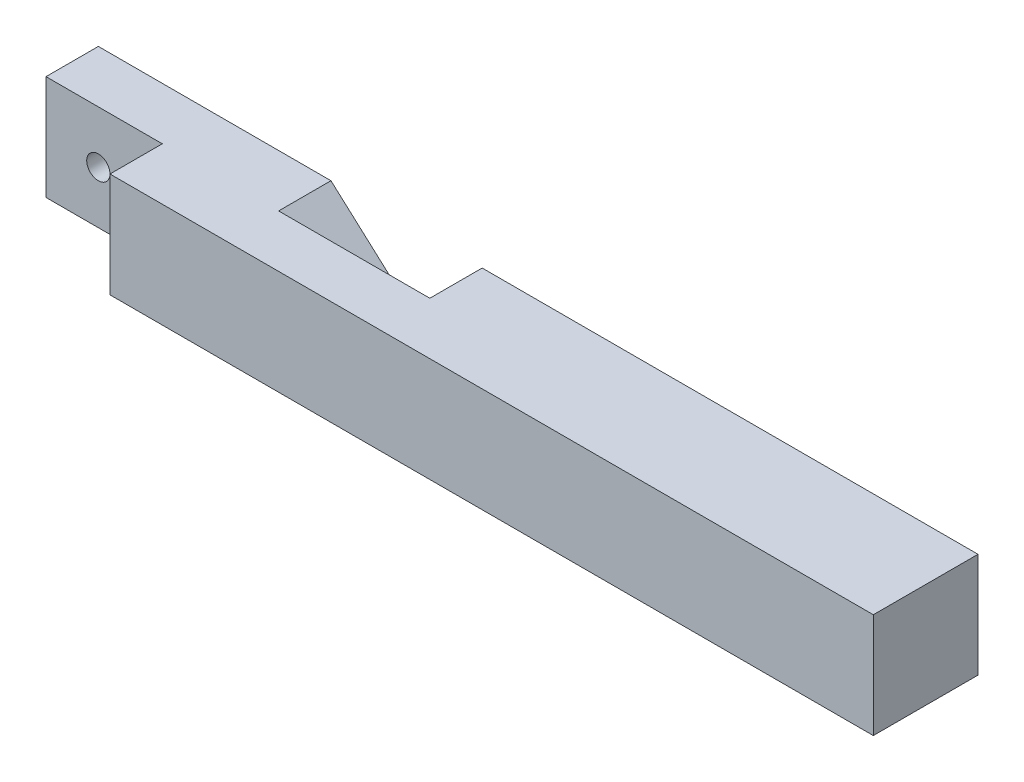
ISO-10303-21;
HEADER;
FILE_DESCRIPTION(('STEP AP214'),'2;1');
FILE_NAME('part.step','',(''),(''),'','','');
FILE_SCHEMA(('AUTOMOTIVE_DESIGN { 1 0 10303 214 1 1 1 1 }'));
ENDSEC;
DATA;
#1=APPLICATION_CONTEXT('core data for automotive mechanical design processes');
#2=APPLICATION_PROTOCOL_DEFINITION('international standard','automotive_design',2000,#1);
#3=PRODUCT_CONTEXT('',#1,'mechanical');
#4=PRODUCT('Part','Part','',(#3));
#5=PRODUCT_RELATED_PRODUCT_CATEGORY('part','',(#4));
#6=PRODUCT_DEFINITION_FORMATION('','',#4);
#7=PRODUCT_DEFINITION_CONTEXT('part definition',#1,'design');
#8=PRODUCT_DEFINITION('design','',#6,#7);
#9=PRODUCT_DEFINITION_SHAPE('','',#8);
#10=(LENGTH_UNIT() NAMED_UNIT(*) SI_UNIT(.MILLI.,.METRE.));
#11=(NAMED_UNIT(*) PLANE_ANGLE_UNIT() SI_UNIT($,.RADIAN.));
#12=(NAMED_UNIT(*) SI_UNIT($,.STERADIAN.) SOLID_ANGLE_UNIT());
#13=UNCERTAINTY_MEASURE_WITH_UNIT(LENGTH_MEASURE(1.E-05),#10,'distance_accuracy_value','');
#14=(GEOMETRIC_REPRESENTATION_CONTEXT(3) GLOBAL_UNCERTAINTY_ASSIGNED_CONTEXT((#13)) GLOBAL_UNIT_ASSIGNED_CONTEXT((#10,
#11,#12)) REPRESENTATION_CONTEXT('',''));
#15=CARTESIAN_POINT('',(0.,0.,0.));
#16=DIRECTION('',(0.,0.,1.));
#17=DIRECTION('',(1.,0.,0.));
#18=AXIS2_PLACEMENT_3D('',#15,#16,#17);
#19=CARTESIAN_POINT('',(0.,9.,0.));
#20=DIRECTION('',(0.,0.,-1.));
#21=DIRECTION('',(-1.,0.,0.));
#22=AXIS2_PLACEMENT_3D('',#19,#20,#21);
#23=PLANE('',#22);
#24=DIRECTION('',(-0.743294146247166,0.66896473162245,0.));
#25=VECTOR('',#24,1.);
#26=CARTESIAN_POINT('',(20.,9.,0.));
#27=LINE('',#26,#25);
#28=CARTESIAN_POINT('',(30.,0.,0.));
#29=VERTEX_POINT('',#28);
#30=CARTESIAN_POINT('',(20.,9.,0.));
#31=VERTEX_POINT('',#30);
#32=EDGE_CURVE('E122',#29,#31,#27,.T.);
#33=ORIENTED_EDGE('',*,*,#32,.F.);
#34=DIRECTION('',(1.,0.,0.));
#35=VECTOR('',#34,1.);
#36=CARTESIAN_POINT('',(0.,0.,0.));
#37=LINE('',#36,#35);
#38=CARTESIAN_POINT('',(0.,0.,0.));
#39=VERTEX_POINT('',#38);
#40=EDGE_CURVE('E170',#39,#29,#37,.T.);
#41=ORIENTED_EDGE('',*,*,#40,.F.);
#42=DIRECTION('',(0.,-1.,0.));
#43=VECTOR('',#42,1.);
#44=CARTESIAN_POINT('',(0.,0.,0.));
#45=LINE('',#44,#43);
#46=CARTESIAN_POINT('',(0.,9.,0.));
#47=VERTEX_POINT('',#46);
#48=EDGE_CURVE('E157',#47,#39,#45,.T.);
#49=ORIENTED_EDGE('',*,*,#48,.F.);
#50=DIRECTION('',(-1.,0.,0.));
#51=VECTOR('',#50,1.);
#52=CARTESIAN_POINT('',(0.,9.,0.));
#53=LINE('',#52,#51);
#54=EDGE_CURVE('E175',#31,#47,#53,.T.);
#55=ORIENTED_EDGE('',*,*,#54,.F.);
#56=EDGE_LOOP('',(#33,#41,#49,#55));
#57=FACE_BOUND('',#56,.T.);
#58=CARTESIAN_POINT('',(4.5,4.5,0.));
#59=DIRECTION('',(0.,0.,1.));
#60=DIRECTION('',(1.,0.,0.));
#61=AXIS2_PLACEMENT_3D('',#58,#59,#60);
#62=CIRCLE('',#61,1.);
#63=CARTESIAN_POINT('',(5.5,4.5,0.));
#64=VERTEX_POINT('',#63);
#65=EDGE_CURVE('E135',#64,#64,#62,.T.);
#66=ORIENTED_EDGE('',*,*,#65,.T.);
#67=EDGE_LOOP('',(#66));
#68=FACE_BOUND('',#67,.T.);
#69=ADVANCED_FACE('F31',(#57,#68),#23,.T.);
#70=CARTESIAN_POINT('',(0.,0.,9.));
#71=DIRECTION('',(1.,0.,0.));
#72=DIRECTION('',(0.,0.,-1.));
#73=AXIS2_PLACEMENT_3D('',#70,#71,#72);
#74=PLANE('',#73);
#75=DIRECTION('',(0.,-1.,0.));
#76=VECTOR('',#75,1.);
#77=CARTESIAN_POINT('',(0.,9.,4.5));
#78=LINE('',#77,#76);
#79=CARTESIAN_POINT('',(0.,9.,4.5));
#80=VERTEX_POINT('',#79);
#81=CARTESIAN_POINT('',(0.,0.,4.5));
#82=VERTEX_POINT('',#81);
#83=EDGE_CURVE('E143',#80,#82,#78,.T.);
#84=ORIENTED_EDGE('',*,*,#83,.F.);
#85=DIRECTION('',(0.,0.,-1.));
#86=VECTOR('',#85,1.);
#87=CARTESIAN_POINT('',(0.,9.,9.));
#88=LINE('',#87,#86);
#89=EDGE_CURVE('E166',#80,#47,#88,.T.);
#90=ORIENTED_EDGE('',*,*,#89,.T.);
#91=ORIENTED_EDGE('',*,*,#48,.T.);
#92=DIRECTION('',(0.,0.,-1.));
#93=VECTOR('',#92,1.);
#94=CARTESIAN_POINT('',(0.,0.,9.));
#95=LINE('',#94,#93);
#96=EDGE_CURVE('E11',#82,#39,#95,.T.);
#97=ORIENTED_EDGE('',*,*,#96,.F.);
#98=EDGE_LOOP('',(#84,#90,#91,#97));
#99=FACE_BOUND('',#98,.T.);
#100=ADVANCED_FACE('F33',(#99),#74,.F.);
#101=CARTESIAN_POINT('',(0.,0.,9.));
#102=DIRECTION('',(0.,1.,0.));
#103=DIRECTION('',(0.,0.,1.));
#104=AXIS2_PLACEMENT_3D('',#101,#102,#103);
#105=PLANE('',#104);
#106=ORIENTED_EDGE('',*,*,#40,.T.);
#107=DIRECTION('',(0.,0.,-1.));
#108=VECTOR('',#107,1.);
#109=CARTESIAN_POINT('',(30.,0.,4.5));
#110=LINE('',#109,#108);
#111=CARTESIAN_POINT('',(30.,0.,4.5));
#112=VERTEX_POINT('',#111);
#113=EDGE_CURVE('E130',#112,#29,#110,.T.);
#114=ORIENTED_EDGE('',*,*,#113,.F.);
#115=DIRECTION('',(-1.,0.,0.));
#116=VECTOR('',#115,1.);
#117=CARTESIAN_POINT('',(30.,0.,4.5));
#118=LINE('',#117,#116);
#119=CARTESIAN_POINT('',(43.,0.,4.5));
#120=VERTEX_POINT('',#119);
#121=EDGE_CURVE('E112',#120,#112,#118,.T.);
#122=ORIENTED_EDGE('',*,*,#121,.F.);
#123=DIRECTION('',(0.,0.,-1.));
#124=VECTOR('',#123,1.);
#125=CARTESIAN_POINT('',(43.,0.,4.5));
#126=LINE('',#125,#124);
#127=CARTESIAN_POINT('',(43.,0.,0.));
#128=VERTEX_POINT('',#127);
#129=EDGE_CURVE('E109',#120,#128,#126,.T.);
#130=ORIENTED_EDGE('',*,*,#129,.T.);
#131=CARTESIAN_POINT('',(75.63,0.,0.));
#132=VERTEX_POINT('',#131);
#133=EDGE_CURVE('E169',#128,#132,#37,.T.);
#134=ORIENTED_EDGE('',*,*,#133,.T.);
#135=DIRECTION('',(0.,0.,-1.));
#136=VECTOR('',#135,1.);
#137=CARTESIAN_POINT('',(75.63,0.,9.));
#138=LINE('',#137,#136);
#139=CARTESIAN_POINT('',(75.63,0.,9.));
#140=VERTEX_POINT('',#139);
#141=EDGE_CURVE('E39',#140,#132,#138,.T.);
#142=ORIENTED_EDGE('',*,*,#141,.F.);
#143=DIRECTION('',(1.,0.,0.));
#144=VECTOR('',#143,1.);
#145=CARTESIAN_POINT('',(0.,0.,9.));
#146=LINE('',#145,#144);
#147=CARTESIAN_POINT('',(10.,0.,9.));
#148=VERTEX_POINT('',#147);
#149=EDGE_CURVE('E159',#148,#140,#146,.T.);
#150=ORIENTED_EDGE('',*,*,#149,.F.);
#151=DIRECTION('',(0.,0.,1.));
#152=VECTOR('',#151,1.);
#153=CARTESIAN_POINT('',(10.,0.,4.5));
#154=LINE('',#153,#152);
#155=CARTESIAN_POINT('',(10.,0.,4.5));
#156=VERTEX_POINT('',#155);
#157=EDGE_CURVE('E54',#156,#148,#154,.T.);
#158=ORIENTED_EDGE('',*,*,#157,.F.);
#159=DIRECTION('',(1.,0.,0.));
#160=VECTOR('',#159,1.);
#161=CARTESIAN_POINT('',(0.,0.,4.5));
#162=LINE('',#161,#160);
#163=EDGE_CURVE('E145',#82,#156,#162,.T.);
#164=ORIENTED_EDGE('',*,*,#163,.F.);
#165=ORIENTED_EDGE('',*,*,#96,.T.);
#166=EDGE_LOOP('',(#106,#114,#122,#130,#134,#142,#150,#158,#164,#165));
#167=FACE_BOUND('',#166,.T.);
#168=ADVANCED_FACE('F206',(#167),#105,.F.);
#169=CARTESIAN_POINT('',(75.63,0.,9.));
#170=DIRECTION('',(-1.,0.,0.));
#171=DIRECTION('',(0.,0.,1.));
#172=AXIS2_PLACEMENT_3D('',#169,#170,#171);
#173=PLANE('',#172);
#174=DIRECTION('',(0.,1.,0.));
#175=VECTOR('',#174,1.);
#176=CARTESIAN_POINT('',(75.63,0.,0.));
#177=LINE('',#176,#175);
#178=CARTESIAN_POINT('',(75.63,9.,0.));
#179=VERTEX_POINT('',#178);
#180=EDGE_CURVE('E173',#132,#179,#177,.T.);
#181=ORIENTED_EDGE('',*,*,#180,.T.);
#182=DIRECTION('',(0.,0.,-1.));
#183=VECTOR('',#182,1.);
#184=CARTESIAN_POINT('',(75.63,9.,9.));
#185=LINE('',#184,#183);
#186=CARTESIAN_POINT('',(75.63,9.,9.));
#187=VERTEX_POINT('',#186);
#188=EDGE_CURVE('E179',#187,#179,#185,.T.);
#189=ORIENTED_EDGE('',*,*,#188,.F.);
#190=DIRECTION('',(0.,1.,0.));
#191=VECTOR('',#190,1.);
#192=CARTESIAN_POINT('',(75.63,0.,9.));
#193=LINE('',#192,#191);
#194=EDGE_CURVE('E161',#140,#187,#193,.T.);
#195=ORIENTED_EDGE('',*,*,#194,.F.);
#196=ORIENTED_EDGE('',*,*,#141,.T.);
#197=EDGE_LOOP('',(#181,#189,#195,#196));
#198=FACE_BOUND('',#197,.T.);
#199=ADVANCED_FACE('F185',(#198),#173,.F.);
#200=CARTESIAN_POINT('',(0.,9.,9.));
#201=DIRECTION('',(0.,-1.,0.));
#202=DIRECTION('',(0.,0.,-1.));
#203=AXIS2_PLACEMENT_3D('',#200,#201,#202);
#204=PLANE('',#203);
#205=DIRECTION('',(1.,0.,0.));
#206=VECTOR('',#205,1.);
#207=CARTESIAN_POINT('',(33.,9.,4.5));
#208=LINE('',#207,#206);
#209=CARTESIAN_POINT('',(20.,9.,4.5));
#210=VERTEX_POINT('',#209);
#211=CARTESIAN_POINT('',(33.,9.,4.5));
#212=VERTEX_POINT('',#211);
#213=EDGE_CURVE('E113',#210,#212,#208,.T.);
#214=ORIENTED_EDGE('',*,*,#213,.F.);
#215=DIRECTION('',(0.,0.,-1.));
#216=VECTOR('',#215,1.);
#217=CARTESIAN_POINT('',(20.,9.,4.5));
#218=LINE('',#217,#216);
#219=EDGE_CURVE('E142',#210,#31,#218,.T.);
#220=ORIENTED_EDGE('',*,*,#219,.T.);
#221=ORIENTED_EDGE('',*,*,#54,.T.);
#222=ORIENTED_EDGE('',*,*,#89,.F.);
#223=DIRECTION('',(-1.,0.,0.));
#224=VECTOR('',#223,1.);
#225=CARTESIAN_POINT('',(0.,9.,4.5));
#226=LINE('',#225,#224);
#227=CARTESIAN_POINT('',(10.,9.,4.5));
#228=VERTEX_POINT('',#227);
#229=EDGE_CURVE('E151',#228,#80,#226,.T.);
#230=ORIENTED_EDGE('',*,*,#229,.F.);
#231=DIRECTION('',(0.,0.,1.));
#232=VECTOR('',#231,1.);
#233=CARTESIAN_POINT('',(10.,9.,4.5));
#234=LINE('',#233,#232);
#235=CARTESIAN_POINT('',(10.,9.,9.));
#236=VERTEX_POINT('',#235);
#237=EDGE_CURVE('E154',#228,#236,#234,.T.);
#238=ORIENTED_EDGE('',*,*,#237,.T.);
#239=DIRECTION('',(-1.,0.,0.));
#240=VECTOR('',#239,1.);
#241=CARTESIAN_POINT('',(0.,9.,9.));
#242=LINE('',#241,#240);
#243=EDGE_CURVE('E163',#187,#236,#242,.T.);
#244=ORIENTED_EDGE('',*,*,#243,.F.);
#245=ORIENTED_EDGE('',*,*,#188,.T.);
#246=CARTESIAN_POINT('',(33.,9.,0.));
#247=VERTEX_POINT('',#246);
#248=EDGE_CURVE('E128',#179,#247,#53,.T.);
#249=ORIENTED_EDGE('',*,*,#248,.T.);
#250=DIRECTION('',(0.,0.,-1.));
#251=VECTOR('',#250,1.);
#252=CARTESIAN_POINT('',(33.,9.,4.5));
#253=LINE('',#252,#251);
#254=EDGE_CURVE('E46',#212,#247,#253,.T.);
#255=ORIENTED_EDGE('',*,*,#254,.F.);
#256=EDGE_LOOP('',(#214,#220,#221,#222,#230,#238,#244,#245,#249,#255));
#257=FACE_BOUND('',#256,.T.);
#258=ADVANCED_FACE('F125',(#257),#204,.F.);
#259=CARTESIAN_POINT('',(0.,9.,9.));
#260=DIRECTION('',(0.,0.,-1.));
#261=DIRECTION('',(-1.,0.,0.));
#262=AXIS2_PLACEMENT_3D('',#259,#260,#261);
#263=PLANE('',#262);
#264=ORIENTED_EDGE('',*,*,#243,.T.);
#265=DIRECTION('',(0.,1.,0.));
#266=VECTOR('',#265,1.);
#267=CARTESIAN_POINT('',(10.,9.,9.));
#268=LINE('',#267,#266);
#269=EDGE_CURVE('E138',#148,#236,#268,.T.);
#270=ORIENTED_EDGE('',*,*,#269,.F.);
#271=ORIENTED_EDGE('',*,*,#149,.T.);
#272=ORIENTED_EDGE('',*,*,#194,.T.);
#273=EDGE_LOOP('',(#264,#270,#271,#272));
#274=FACE_BOUND('',#273,.T.);
#275=ADVANCED_FACE('F218',(#274),#263,.F.);
#276=DIRECTION('',(0.743294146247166,-0.66896473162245,0.));
#277=VECTOR('',#276,1.);
#278=CARTESIAN_POINT('',(43.,0.,0.));
#279=LINE('',#278,#277);
#280=EDGE_CURVE('E192',#247,#128,#279,.T.);
#281=ORIENTED_EDGE('',*,*,#280,.F.);
#282=ORIENTED_EDGE('',*,*,#248,.F.);
#283=ORIENTED_EDGE('',*,*,#180,.F.);
#284=ORIENTED_EDGE('',*,*,#133,.F.);
#285=EDGE_LOOP('',(#281,#282,#283,#284));
#286=FACE_BOUND('',#285,.T.);
#287=ADVANCED_FACE('F191',(#286),#23,.T.);
#288=CARTESIAN_POINT('',(10.,9.,4.5));
#289=DIRECTION('',(1.,0.,0.));
#290=DIRECTION('',(0.,1.,0.));
#291=AXIS2_PLACEMENT_3D('',#288,#289,#290);
#292=PLANE('',#291);
#293=ORIENTED_EDGE('',*,*,#269,.T.);
#294=ORIENTED_EDGE('',*,*,#237,.F.);
#295=DIRECTION('',(0.,1.,0.));
#296=VECTOR('',#295,1.);
#297=CARTESIAN_POINT('',(10.,9.,4.5));
#298=LINE('',#297,#296);
#299=EDGE_CURVE('E148',#156,#228,#298,.T.);
#300=ORIENTED_EDGE('',*,*,#299,.F.);
#301=ORIENTED_EDGE('',*,*,#157,.T.);
#302=EDGE_LOOP('',(#293,#294,#300,#301));
#303=FACE_BOUND('',#302,.T.);
#304=ADVANCED_FACE('F216',(#303),#292,.F.);
#305=CARTESIAN_POINT('',(0.,0.,4.5));
#306=DIRECTION('',(0.,0.,1.));
#307=DIRECTION('',(1.,0.,0.));
#308=AXIS2_PLACEMENT_3D('',#305,#306,#307);
#309=PLANE('',#308);
#310=CARTESIAN_POINT('',(4.5,4.5,4.5));
#311=DIRECTION('',(0.,0.,1.));
#312=DIRECTION('',(1.,0.,0.));
#313=AXIS2_PLACEMENT_3D('',#310,#311,#312);
#314=CIRCLE('',#313,1.);
#315=CARTESIAN_POINT('',(5.5,4.5,4.5));
#316=VERTEX_POINT('',#315);
#317=EDGE_CURVE('E139',#316,#316,#314,.T.);
#318=ORIENTED_EDGE('',*,*,#317,.F.);
#319=EDGE_LOOP('',(#318));
#320=FACE_BOUND('',#319,.T.);
#321=ORIENTED_EDGE('',*,*,#83,.T.);
#322=ORIENTED_EDGE('',*,*,#163,.T.);
#323=ORIENTED_EDGE('',*,*,#299,.T.);
#324=ORIENTED_EDGE('',*,*,#229,.T.);
#325=EDGE_LOOP('',(#321,#322,#323,#324));
#326=FACE_BOUND('',#325,.T.);
#327=ADVANCED_FACE('F215',(#320,#326),#309,.T.);
#328=CARTESIAN_POINT('',(4.5,4.5,0.));
#329=DIRECTION('',(0.,0.,1.));
#330=DIRECTION('',(1.,0.,0.));
#331=AXIS2_PLACEMENT_3D('',#328,#329,#330);
#332=CYLINDRICAL_SURFACE('',#331,1.);
#333=ORIENTED_EDGE('',*,*,#65,.F.);
#334=EDGE_LOOP('',(#333));
#335=FACE_BOUND('',#334,.T.);
#336=ORIENTED_EDGE('',*,*,#317,.T.);
#337=EDGE_LOOP('',(#336));
#338=FACE_BOUND('',#337,.T.);
#339=ADVANCED_FACE('F265',(#335,#338),#332,.F.);
#340=CARTESIAN_POINT('',(20.,9.,4.5));
#341=DIRECTION('',(-0.66896473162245,-0.743294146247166,0.));
#342=DIRECTION('',(0.743294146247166,-0.66896473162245,0.));
#343=AXIS2_PLACEMENT_3D('',#340,#341,#342);
#344=PLANE('',#343);
#345=ORIENTED_EDGE('',*,*,#32,.T.);
#346=ORIENTED_EDGE('',*,*,#219,.F.);
#347=DIRECTION('',(-0.743294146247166,0.66896473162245,0.));
#348=VECTOR('',#347,1.);
#349=CARTESIAN_POINT('',(20.,9.,4.5));
#350=LINE('',#349,#348);
#351=EDGE_CURVE('E119',#112,#210,#350,.T.);
#352=ORIENTED_EDGE('',*,*,#351,.F.);
#353=ORIENTED_EDGE('',*,*,#113,.T.);
#354=EDGE_LOOP('',(#345,#346,#352,#353));
#355=FACE_BOUND('',#354,.T.);
#356=ADVANCED_FACE('F200',(#355),#344,.F.);
#357=CARTESIAN_POINT('',(43.,0.,4.5));
#358=DIRECTION('',(0.66896473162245,0.743294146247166,0.));
#359=DIRECTION('',(-0.743294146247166,0.66896473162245,0.));
#360=AXIS2_PLACEMENT_3D('',#357,#358,#359);
#361=PLANE('',#360);
#362=ORIENTED_EDGE('',*,*,#280,.T.);
#363=ORIENTED_EDGE('',*,*,#129,.F.);
#364=DIRECTION('',(0.743294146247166,-0.66896473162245,0.));
#365=VECTOR('',#364,1.);
#366=CARTESIAN_POINT('',(43.,0.,4.5));
#367=LINE('',#366,#365);
#368=EDGE_CURVE('E105',#212,#120,#367,.T.);
#369=ORIENTED_EDGE('',*,*,#368,.F.);
#370=ORIENTED_EDGE('',*,*,#254,.T.);
#371=EDGE_LOOP('',(#362,#363,#369,#370));
#372=FACE_BOUND('',#371,.T.);
#373=ADVANCED_FACE('F107',(#372),#361,.F.);
#374=CARTESIAN_POINT('',(33.,8.99999999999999,4.5));
#375=DIRECTION('',(0.,0.,-1.));
#376=DIRECTION('',(-1.,0.,0.));
#377=AXIS2_PLACEMENT_3D('',#374,#375,#376);
#378=PLANE('',#377);
#379=ORIENTED_EDGE('',*,*,#213,.T.);
#380=ORIENTED_EDGE('',*,*,#368,.T.);
#381=ORIENTED_EDGE('',*,*,#121,.T.);
#382=ORIENTED_EDGE('',*,*,#351,.T.);
#383=EDGE_LOOP('',(#379,#380,#381,#382));
#384=FACE_BOUND('',#383,.T.);
#385=ADVANCED_FACE('F117',(#384),#378,.T.);
#386=CLOSED_SHELL('',(#69,#100,#168,#199,#258,#275,#287,#304,#327,#339,#356,#373,#385));
#387=MANIFOLD_SOLID_BREP('B2',#386);
#388=ADVANCED_BREP_SHAPE_REPRESENTATION('',(#18,#387),#14);
#389=SHAPE_DEFINITION_REPRESENTATION(#9,#388);
ENDSEC;
END-ISO-10303-21;
